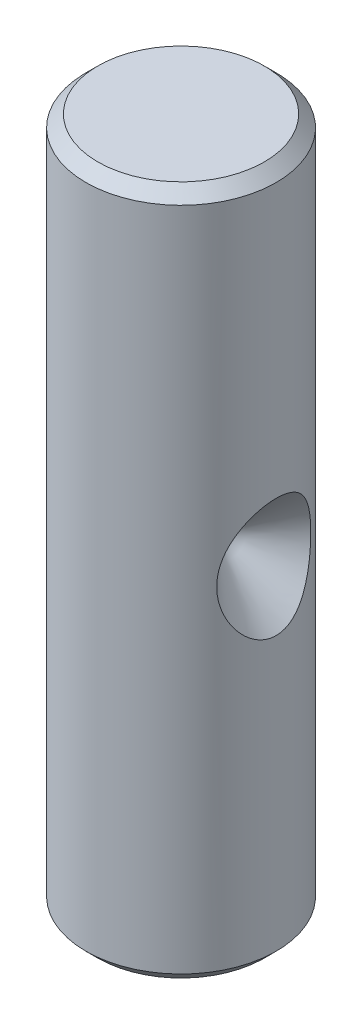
from build123d import *

# Parameters (mm, degrees)
ESQUISSE1_R      = 4
EXTRUSION1_DEPTH = 29
CHANFREIN1_SIZE  = 0.5


with BuildPart() as part:
    # Esquisse1 → Extrusion1 (new body)
    with BuildSketch(Plane(origin=(0, 0, 0), x_dir=(1, 0, 0), z_dir=(0, 1, 0))):
        with Locations(Location((0, 0, 0), (0, 0, 90))):
            Circle(ESQUISSE1_R)
    extrude(amount=EXTRUSION1_DEPTH)

    # Chanfrein1
    chanfrein1_edges = [part.edges().sort_by_distance(p)[0] for p in [
        (0, 0, 4),
        (0, 29, 4),
    ]]
    chamfer(chanfrein1_edges, length=CHANFREIN1_SIZE)

    # Esquisse3 → Enl_vement de mati_re-R_volution7 (revolve, cut)
    with BuildSketch(Plane.XY, mode=Mode.PRIVATE) as enl_vement_de_mati_re_r_volution7_sk:
        Polygon((1.5, 14.5), (9.302166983, 22.302166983), (9.302166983, 14.5), align=None)
    revolve(enl_vement_de_mati_re_r_volution7_sk.sketch.rotate(Axis((6.751846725, 14.5, 0), (-1, 0, 0)), 90), axis=Axis((6.751846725, 14.5, 0), (-1, 0, 0)), mode=Mode.SUBTRACT)


solid = part.part
